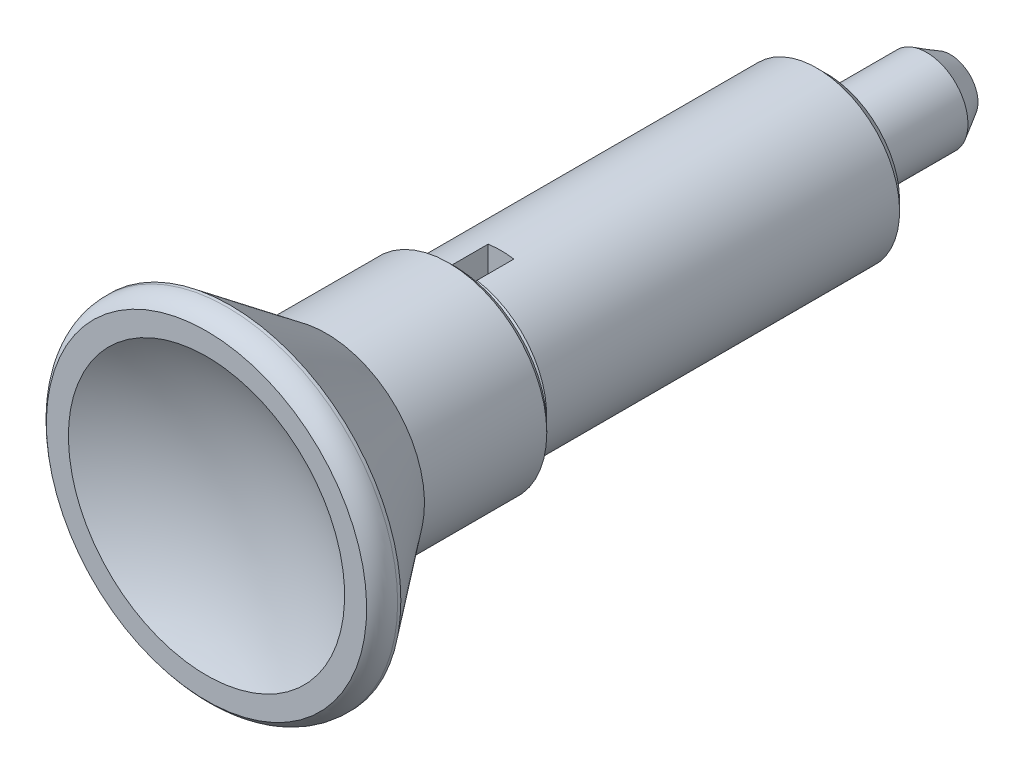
ISO-10303-21;
HEADER;
FILE_DESCRIPTION(('STEP AP214'),'2;1');
FILE_NAME('part.step','',(''),(''),'','','');
FILE_SCHEMA(('AUTOMOTIVE_DESIGN { 1 0 10303 214 1 1 1 1 }'));
ENDSEC;
DATA;
#1=APPLICATION_CONTEXT('core data for automotive mechanical design processes');
#2=APPLICATION_PROTOCOL_DEFINITION('international standard','automotive_design',2000,#1);
#3=PRODUCT_CONTEXT('',#1,'mechanical');
#4=PRODUCT('Part','Part','',(#3));
#5=PRODUCT_RELATED_PRODUCT_CATEGORY('part','',(#4));
#6=PRODUCT_DEFINITION_FORMATION('','',#4);
#7=PRODUCT_DEFINITION_CONTEXT('part definition',#1,'design');
#8=PRODUCT_DEFINITION('design','',#6,#7);
#9=PRODUCT_DEFINITION_SHAPE('','',#8);
#10=(LENGTH_UNIT() NAMED_UNIT(*) SI_UNIT(.MILLI.,.METRE.));
#11=(NAMED_UNIT(*) PLANE_ANGLE_UNIT() SI_UNIT($,.RADIAN.));
#12=(NAMED_UNIT(*) SI_UNIT($,.STERADIAN.) SOLID_ANGLE_UNIT());
#13=UNCERTAINTY_MEASURE_WITH_UNIT(LENGTH_MEASURE(1.E-05),#10,'distance_accuracy_value','');
#14=(GEOMETRIC_REPRESENTATION_CONTEXT(3) GLOBAL_UNCERTAINTY_ASSIGNED_CONTEXT((#13)) GLOBAL_UNIT_ASSIGNED_CONTEXT((#10,
#11,#12)) REPRESENTATION_CONTEXT('',''));
#15=CARTESIAN_POINT('',(0.,0.,0.));
#16=DIRECTION('',(0.,0.,1.));
#17=DIRECTION('',(1.,0.,0.));
#18=AXIS2_PLACEMENT_3D('',#15,#16,#17);
#19=CARTESIAN_POINT('',(-1.25,-19.,31.5));
#20=DIRECTION('',(0.,0.,1.));
#21=DIRECTION('',(0.,-1.,0.));
#22=AXIS2_PLACEMENT_3D('',#19,#20,#21);
#23=PLANE('',#22);
#24=DIRECTION('',(0.,1.,0.));
#25=VECTOR('',#24,1.);
#26=CARTESIAN_POINT('',(-1.25,-19.,31.5));
#27=LINE('',#26,#25);
#28=CARTESIAN_POINT('',(-1.25,-7.90174031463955,31.5));
#29=VERTEX_POINT('',#28);
#30=CARTESIAN_POINT('',(-1.25,-3.79967103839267,31.5));
#31=VERTEX_POINT('',#30);
#32=EDGE_CURVE('E83',#29,#31,#27,.T.);
#33=ORIENTED_EDGE('',*,*,#32,.F.);
#34=CARTESIAN_POINT('',(0.,0.,31.5));
#35=DIRECTION('',(0.,0.,1.));
#36=DIRECTION('',(0.,-1.,0.));
#37=AXIS2_PLACEMENT_3D('',#34,#35,#36);
#38=CIRCLE('',#37,8.);
#39=CARTESIAN_POINT('',(1.25,-7.90174031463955,31.5));
#40=VERTEX_POINT('',#39);
#41=EDGE_CURVE('E77',#40,#29,#38,.F.);
#42=ORIENTED_EDGE('',*,*,#41,.F.);
#43=DIRECTION('',(0.,-1.,0.));
#44=VECTOR('',#43,1.);
#45=CARTESIAN_POINT('',(1.25,-19.,31.5));
#46=LINE('',#45,#44);
#47=CARTESIAN_POINT('',(1.25,-3.79967103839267,31.5));
#48=VERTEX_POINT('',#47);
#49=EDGE_CURVE('E80',#48,#40,#46,.T.);
#50=ORIENTED_EDGE('',*,*,#49,.F.);
#51=CARTESIAN_POINT('',(0.,0.,31.5));
#52=DIRECTION('',(0.,0.,1.));
#53=DIRECTION('',(0.,-1.,0.));
#54=AXIS2_PLACEMENT_3D('',#51,#52,#53);
#55=CIRCLE('',#54,4.);
#56=EDGE_CURVE('E102',#31,#48,#55,.T.);
#57=ORIENTED_EDGE('',*,*,#56,.F.);
#58=EDGE_LOOP('',(#33,#42,#50,#57));
#59=FACE_BOUND('',#58,.T.);
#60=ADVANCED_FACE('F14',(#59),#23,.T.);
#61=CARTESIAN_POINT('',(-1.25,-19.,31.5));
#62=DIRECTION('',(0.,0.,1.));
#63=DIRECTION('',(0.,-1.,0.));
#64=AXIS2_PLACEMENT_3D('',#61,#62,#63);
#65=PLANE('',#64);
#66=DIRECTION('',(0.,-1.,0.));
#67=VECTOR('',#66,1.);
#68=CARTESIAN_POINT('',(1.25,-19.,31.5));
#69=LINE('',#68,#67);
#70=CARTESIAN_POINT('',(1.25,7.90174031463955,31.5));
#71=VERTEX_POINT('',#70);
#72=CARTESIAN_POINT('',(1.25,3.79967103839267,31.5));
#73=VERTEX_POINT('',#72);
#74=EDGE_CURVE('E210',#71,#73,#69,.T.);
#75=ORIENTED_EDGE('',*,*,#74,.F.);
#76=CARTESIAN_POINT('',(0.,0.,31.5));
#77=DIRECTION('',(0.,0.,1.));
#78=DIRECTION('',(0.,-1.,0.));
#79=AXIS2_PLACEMENT_3D('',#76,#77,#78);
#80=CIRCLE('',#79,8.);
#81=CARTESIAN_POINT('',(-1.25,7.90174031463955,31.5));
#82=VERTEX_POINT('',#81);
#83=EDGE_CURVE('E86',#82,#71,#80,.F.);
#84=ORIENTED_EDGE('',*,*,#83,.F.);
#85=DIRECTION('',(0.,1.,0.));
#86=VECTOR('',#85,1.);
#87=CARTESIAN_POINT('',(-1.25,-19.,31.5));
#88=LINE('',#87,#86);
#89=CARTESIAN_POINT('',(-1.25,3.79967103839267,31.5));
#90=VERTEX_POINT('',#89);
#91=EDGE_CURVE('E228',#90,#82,#88,.T.);
#92=ORIENTED_EDGE('',*,*,#91,.F.);
#93=CARTESIAN_POINT('',(0.,0.,31.5));
#94=DIRECTION('',(0.,0.,1.));
#95=DIRECTION('',(0.,-1.,0.));
#96=AXIS2_PLACEMENT_3D('',#93,#94,#95);
#97=CIRCLE('',#96,4.);
#98=EDGE_CURVE('E214',#73,#90,#97,.T.);
#99=ORIENTED_EDGE('',*,*,#98,.F.);
#100=EDGE_LOOP('',(#75,#84,#92,#99));
#101=FACE_BOUND('',#100,.T.);
#102=ADVANCED_FACE('F253',(#101),#65,.T.);
#103=CARTESIAN_POINT('',(0.,0.,0.));
#104=DIRECTION('',(0.,0.,1.));
#105=DIRECTION('',(0.,-1.,0.));
#106=AXIS2_PLACEMENT_3D('',#103,#104,#105);
#107=CYLINDRICAL_SURFACE('',#106,8.);
#108=DIRECTION('',(0.,0.,1.));
#109=VECTOR('',#108,1.);
#110=CARTESIAN_POINT('',(-1.25,7.90174031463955,36.));
#111=LINE('',#110,#109);
#112=CARTESIAN_POINT('',(-1.25,7.90174031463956,35.08));
#113=VERTEX_POINT('',#112);
#114=EDGE_CURVE('E231',#82,#113,#111,.T.);
#115=ORIENTED_EDGE('',*,*,#114,.F.);
#116=ORIENTED_EDGE('',*,*,#83,.T.);
#117=DIRECTION('',(0.,0.,1.));
#118=VECTOR('',#117,1.);
#119=CARTESIAN_POINT('',(1.25,7.90174031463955,31.5));
#120=LINE('',#119,#118);
#121=CARTESIAN_POINT('',(1.25,7.90174031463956,35.08));
#122=VERTEX_POINT('',#121);
#123=EDGE_CURVE('E209',#122,#71,#120,.F.);
#124=ORIENTED_EDGE('',*,*,#123,.F.);
#125=CARTESIAN_POINT('',(0.,0.,35.08));
#126=DIRECTION('',(0.,0.,-1.));
#127=DIRECTION('',(0.,1.,0.));
#128=AXIS2_PLACEMENT_3D('',#125,#126,#127);
#129=CIRCLE('',#128,8.);
#130=CARTESIAN_POINT('',(1.25,-7.90174031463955,35.08));
#131=VERTEX_POINT('',#130);
#132=EDGE_CURVE('E98',#131,#122,#129,.F.);
#133=ORIENTED_EDGE('',*,*,#132,.F.);
#134=DIRECTION('',(0.,0.,1.));
#135=VECTOR('',#134,1.);
#136=CARTESIAN_POINT('',(1.25,-7.90174031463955,31.5));
#137=LINE('',#136,#135);
#138=EDGE_CURVE('E91',#40,#131,#137,.T.);
#139=ORIENTED_EDGE('',*,*,#138,.F.);
#140=ORIENTED_EDGE('',*,*,#41,.T.);
#141=DIRECTION('',(0.,0.,1.));
#142=VECTOR('',#141,1.);
#143=CARTESIAN_POINT('',(-1.25,-7.90174031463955,36.));
#144=LINE('',#143,#142);
#145=CARTESIAN_POINT('',(-1.25,-7.90174031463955,35.08));
#146=VERTEX_POINT('',#145);
#147=EDGE_CURVE('E219',#146,#29,#144,.F.);
#148=ORIENTED_EDGE('',*,*,#147,.F.);
#149=CARTESIAN_POINT('',(0.,0.,35.08));
#150=DIRECTION('',(0.,0.,-1.));
#151=DIRECTION('',(0.,1.,0.));
#152=AXIS2_PLACEMENT_3D('',#149,#150,#151);
#153=CIRCLE('',#152,8.);
#154=EDGE_CURVE('E233',#113,#146,#153,.F.);
#155=ORIENTED_EDGE('',*,*,#154,.F.);
#156=EDGE_LOOP('',(#115,#116,#124,#133,#139,#140,#148,#155));
#157=FACE_BOUND('',#156,.T.);
#158=CARTESIAN_POINT('',(0.,0.,0.92));
#159=DIRECTION('',(0.,0.,1.));
#160=DIRECTION('',(0.,-1.,0.));
#161=AXIS2_PLACEMENT_3D('',#158,#159,#160);
#162=CIRCLE('',#161,8.);
#163=CARTESIAN_POINT('',(0.,-8.,0.92));
#164=VERTEX_POINT('',#163);
#165=EDGE_CURVE('E87',#164,#164,#162,.T.);
#166=ORIENTED_EDGE('',*,*,#165,.T.);
#167=EDGE_LOOP('',(#166));
#168=FACE_BOUND('',#167,.T.);
#169=ADVANCED_FACE('F93',(#157,#168),#107,.T.);
#170=CARTESIAN_POINT('',(1.25,-19.,31.5));
#171=DIRECTION('',(-1.,0.,0.));
#172=DIRECTION('',(0.,-1.,0.));
#173=AXIS2_PLACEMENT_3D('',#170,#171,#172);
#174=PLANE('',#173);
#175=ORIENTED_EDGE('',*,*,#138,.T.);
#176=CARTESIAN_POINT('',(1.25,-6.9687803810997,36.));
#177=CARTESIAN_POINT('',(1.25,-7.12440639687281,35.8468012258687));
#178=CARTESIAN_POINT('',(1.25,-7.279966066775,35.6935351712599));
#179=CARTESIAN_POINT('',(1.25,-7.59095271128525,35.3868685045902));
#180=CARTESIAN_POINT('',(1.25,-7.74637968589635,35.2334678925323));
#181=CARTESIAN_POINT('',(1.25,-7.90174031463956,35.08));
#182=B_SPLINE_CURVE_WITH_KNOTS('',3,(#176,#177,#178,#179,#180,#181),.UNSPECIFIED.,.F.,.F.,(4,2,
4),(0.,0.655136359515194,1.31027270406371),.UNSPECIFIED.);
#183=CARTESIAN_POINT('',(1.25,-6.9687803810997,36.));
#184=VERTEX_POINT('',#183);
#185=EDGE_CURVE('E222',#184,#131,#182,.T.);
#186=ORIENTED_EDGE('',*,*,#185,.F.);
#187=DIRECTION('',(0.,-1.,0.));
#188=VECTOR('',#187,1.);
#189=CARTESIAN_POINT('',(1.25,0.,36.));
#190=LINE('',#189,#188);
#191=CARTESIAN_POINT('',(1.25,-3.79967103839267,36.));
#192=VERTEX_POINT('',#191);
#193=EDGE_CURVE('E204',#184,#192,#190,.F.);
#194=ORIENTED_EDGE('',*,*,#193,.T.);
#195=DIRECTION('',(0.,0.,1.));
#196=VECTOR('',#195,1.);
#197=CARTESIAN_POINT('',(1.25,-3.79967103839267,-12.));
#198=LINE('',#197,#196);
#199=EDGE_CURVE('E107',#48,#192,#198,.T.);
#200=ORIENTED_EDGE('',*,*,#199,.F.);
#201=ORIENTED_EDGE('',*,*,#49,.T.);
#202=EDGE_LOOP('',(#175,#186,#194,#200,#201));
#203=FACE_BOUND('',#202,.T.);
#204=ADVANCED_FACE('F104',(#203),#174,.T.);
#205=CARTESIAN_POINT('',(0.,0.,-12.));
#206=DIRECTION('',(0.,0.,1.));
#207=DIRECTION('',(0.,-1.,0.));
#208=AXIS2_PLACEMENT_3D('',#205,#206,#207);
#209=CYLINDRICAL_SURFACE('',#208,4.);
#210=ORIENTED_EDGE('',*,*,#199,.T.);
#211=CARTESIAN_POINT('',(0.,0.,36.));
#212=DIRECTION('',(0.,0.,1.));
#213=DIRECTION('',(0.,-1.,0.));
#214=AXIS2_PLACEMENT_3D('',#211,#212,#213);
#215=CIRCLE('',#214,4.);
#216=CARTESIAN_POINT('',(-1.25,-3.79967103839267,36.));
#217=VERTEX_POINT('',#216);
#218=EDGE_CURVE('E203',#192,#217,#215,.F.);
#219=ORIENTED_EDGE('',*,*,#218,.T.);
#220=DIRECTION('',(0.,0.,1.));
#221=VECTOR('',#220,1.);
#222=CARTESIAN_POINT('',(-1.25,-3.79967103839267,36.));
#223=LINE('',#222,#221);
#224=EDGE_CURVE('E216',#31,#217,#223,.T.);
#225=ORIENTED_EDGE('',*,*,#224,.F.);
#226=ORIENTED_EDGE('',*,*,#56,.T.);
#227=EDGE_LOOP('',(#210,#219,#225,#226));
#228=FACE_BOUND('',#227,.T.);
#229=ADVANCED_FACE('F281',(#228),#209,.T.);
#230=CARTESIAN_POINT('',(-1.25,-19.,36.));
#231=DIRECTION('',(1.,0.,0.));
#232=DIRECTION('',(0.,1.,0.));
#233=AXIS2_PLACEMENT_3D('',#230,#231,#232);
#234=PLANE('',#233);
#235=CARTESIAN_POINT('',(-1.25,-7.90174031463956,35.08));
#236=CARTESIAN_POINT('',(-1.25,-7.74637968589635,35.2334678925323));
#237=CARTESIAN_POINT('',(-1.25,-7.59095271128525,35.3868685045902));
#238=CARTESIAN_POINT('',(-1.25,-7.279966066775,35.6935351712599));
#239=CARTESIAN_POINT('',(-1.25,-7.12440639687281,35.8468012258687));
#240=CARTESIAN_POINT('',(-1.25,-6.9687803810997,36.));
#241=B_SPLINE_CURVE_WITH_KNOTS('',3,(#235,#236,#237,#238,#239,#240),.UNSPECIFIED.,.F.,.F.,(4,2,
4),(0.,0.655136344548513,1.31027270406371),.UNSPECIFIED.);
#242=CARTESIAN_POINT('',(-1.25,-6.9687803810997,36.));
#243=VERTEX_POINT('',#242);
#244=EDGE_CURVE('E232',#146,#243,#241,.T.);
#245=ORIENTED_EDGE('',*,*,#244,.F.);
#246=ORIENTED_EDGE('',*,*,#147,.T.);
#247=ORIENTED_EDGE('',*,*,#32,.T.);
#248=ORIENTED_EDGE('',*,*,#224,.T.);
#249=DIRECTION('',(0.,-1.,0.));
#250=VECTOR('',#249,1.);
#251=CARTESIAN_POINT('',(-1.25,0.,36.));
#252=LINE('',#251,#250);
#253=EDGE_CURVE('E201',#217,#243,#252,.T.);
#254=ORIENTED_EDGE('',*,*,#253,.T.);
#255=EDGE_LOOP('',(#245,#246,#247,#248,#254));
#256=FACE_BOUND('',#255,.T.);
#257=ADVANCED_FACE('F239',(#256),#234,.T.);
#258=CARTESIAN_POINT('',(0.,0.,35.08));
#259=DIRECTION('',(0.,0.,-1.));
#260=DIRECTION('',(0.,1.,0.));
#261=AXIS2_PLACEMENT_3D('',#258,#259,#260);
#262=CONICAL_SURFACE('',#261,8.,0.78539816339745);
#263=ORIENTED_EDGE('',*,*,#244,.T.);
#264=CARTESIAN_POINT('',(0.,0.,36.));
#265=DIRECTION('',(0.,0.,-1.));
#266=DIRECTION('',(0.,1.,0.));
#267=AXIS2_PLACEMENT_3D('',#264,#265,#266);
#268=CIRCLE('',#267,7.08);
#269=CARTESIAN_POINT('',(-1.25,6.9687803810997,36.));
#270=VERTEX_POINT('',#269);
#271=EDGE_CURVE('E200',#243,#270,#268,.T.);
#272=ORIENTED_EDGE('',*,*,#271,.T.);
#273=CARTESIAN_POINT('',(-1.25,7.90174031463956,35.08));
#274=CARTESIAN_POINT('',(-1.25,7.74637968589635,35.2334678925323));
#275=CARTESIAN_POINT('',(-1.25,7.59095271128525,35.3868685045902));
#276=CARTESIAN_POINT('',(-1.25,7.279966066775,35.6935351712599));
#277=CARTESIAN_POINT('',(-1.25,7.12440639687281,35.8468012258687));
#278=CARTESIAN_POINT('',(-1.25,6.9687803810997,36.));
#279=B_SPLINE_CURVE_WITH_KNOTS('',3,(#273,#274,#275,#276,#277,#278),.UNSPECIFIED.,.F.,.F.,(4,2,
4),(0.,0.655136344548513,1.31027270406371),.UNSPECIFIED.);
#280=EDGE_CURVE('E215',#113,#270,#279,.T.);
#281=ORIENTED_EDGE('',*,*,#280,.F.);
#282=ORIENTED_EDGE('',*,*,#154,.T.);
#283=EDGE_LOOP('',(#263,#272,#281,#282));
#284=FACE_BOUND('',#283,.T.);
#285=ADVANCED_FACE('F244',(#284),#262,.T.);
#286=CARTESIAN_POINT('',(-1.25,-19.,36.));
#287=DIRECTION('',(1.,0.,0.));
#288=DIRECTION('',(0.,1.,0.));
#289=AXIS2_PLACEMENT_3D('',#286,#287,#288);
#290=PLANE('',#289);
#291=ORIENTED_EDGE('',*,*,#114,.T.);
#292=ORIENTED_EDGE('',*,*,#280,.T.);
#293=DIRECTION('',(0.,-1.,0.));
#294=VECTOR('',#293,1.);
#295=CARTESIAN_POINT('',(-1.25,0.,36.));
#296=LINE('',#295,#294);
#297=CARTESIAN_POINT('',(-1.25,3.79967103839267,36.));
#298=VERTEX_POINT('',#297);
#299=EDGE_CURVE('E197',#270,#298,#296,.T.);
#300=ORIENTED_EDGE('',*,*,#299,.T.);
#301=DIRECTION('',(0.,0.,1.));
#302=VECTOR('',#301,1.);
#303=CARTESIAN_POINT('',(-1.25,3.79967103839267,-12.));
#304=LINE('',#303,#302);
#305=EDGE_CURVE('E211',#90,#298,#304,.T.);
#306=ORIENTED_EDGE('',*,*,#305,.F.);
#307=ORIENTED_EDGE('',*,*,#91,.T.);
#308=EDGE_LOOP('',(#291,#292,#300,#306,#307));
#309=FACE_BOUND('',#308,.T.);
#310=ADVANCED_FACE('F249',(#309),#290,.T.);
#311=CARTESIAN_POINT('',(0.,0.,-12.));
#312=DIRECTION('',(0.,0.,1.));
#313=DIRECTION('',(0.,-1.,0.));
#314=AXIS2_PLACEMENT_3D('',#311,#312,#313);
#315=CYLINDRICAL_SURFACE('',#314,4.);
#316=DIRECTION('',(0.,0.,1.));
#317=VECTOR('',#316,1.);
#318=CARTESIAN_POINT('',(1.25,3.79967103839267,31.5));
#319=LINE('',#318,#317);
#320=CARTESIAN_POINT('',(1.25,3.79967103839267,36.));
#321=VERTEX_POINT('',#320);
#322=EDGE_CURVE('E207',#73,#321,#319,.T.);
#323=ORIENTED_EDGE('',*,*,#322,.F.);
#324=ORIENTED_EDGE('',*,*,#98,.T.);
#325=ORIENTED_EDGE('',*,*,#305,.T.);
#326=CARTESIAN_POINT('',(0.,0.,36.));
#327=DIRECTION('',(0.,0.,1.));
#328=DIRECTION('',(0.,-1.,0.));
#329=AXIS2_PLACEMENT_3D('',#326,#327,#328);
#330=CIRCLE('',#329,4.);
#331=EDGE_CURVE('E196',#298,#321,#330,.F.);
#332=ORIENTED_EDGE('',*,*,#331,.T.);
#333=EDGE_LOOP('',(#323,#324,#325,#332));
#334=FACE_BOUND('',#333,.T.);
#335=ADVANCED_FACE('F422',(#334),#315,.T.);
#336=CARTESIAN_POINT('',(1.25,-19.,31.5));
#337=DIRECTION('',(-1.,0.,0.));
#338=DIRECTION('',(0.,-1.,0.));
#339=AXIS2_PLACEMENT_3D('',#336,#337,#338);
#340=PLANE('',#339);
#341=CARTESIAN_POINT('',(1.25,7.90174031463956,35.08));
#342=CARTESIAN_POINT('',(1.25,7.74637968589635,35.2334678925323));
#343=CARTESIAN_POINT('',(1.25,7.59095271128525,35.3868685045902));
#344=CARTESIAN_POINT('',(1.25,7.279966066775,35.6935351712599));
#345=CARTESIAN_POINT('',(1.25,7.12440639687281,35.8468012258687));
#346=CARTESIAN_POINT('',(1.25,6.9687803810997,36.));
#347=B_SPLINE_CURVE_WITH_KNOTS('',3,(#341,#342,#343,#344,#345,#346),.UNSPECIFIED.,.F.,.F.,(4,2,
4),(0.,0.655136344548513,1.31027270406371),.UNSPECIFIED.);
#348=CARTESIAN_POINT('',(1.25,6.9687803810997,36.));
#349=VERTEX_POINT('',#348);
#350=EDGE_CURVE('E225',#122,#349,#347,.T.);
#351=ORIENTED_EDGE('',*,*,#350,.F.);
#352=ORIENTED_EDGE('',*,*,#123,.T.);
#353=ORIENTED_EDGE('',*,*,#74,.T.);
#354=ORIENTED_EDGE('',*,*,#322,.T.);
#355=DIRECTION('',(0.,-1.,0.));
#356=VECTOR('',#355,1.);
#357=CARTESIAN_POINT('',(1.25,0.,36.));
#358=LINE('',#357,#356);
#359=EDGE_CURVE('E33',#321,#349,#358,.F.);
#360=ORIENTED_EDGE('',*,*,#359,.T.);
#361=EDGE_LOOP('',(#351,#352,#353,#354,#360));
#362=FACE_BOUND('',#361,.T.);
#363=ADVANCED_FACE('F255',(#362),#340,.T.);
#364=CARTESIAN_POINT('',(0.,0.,35.08));
#365=DIRECTION('',(0.,0.,-1.));
#366=DIRECTION('',(0.,1.,0.));
#367=AXIS2_PLACEMENT_3D('',#364,#365,#366);
#368=CONICAL_SURFACE('',#367,8.,0.78539816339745);
#369=ORIENTED_EDGE('',*,*,#185,.T.);
#370=ORIENTED_EDGE('',*,*,#132,.T.);
#371=ORIENTED_EDGE('',*,*,#350,.T.);
#372=CARTESIAN_POINT('',(0.,0.,36.));
#373=DIRECTION('',(0.,0.,-1.));
#374=DIRECTION('',(0.,1.,0.));
#375=AXIS2_PLACEMENT_3D('',#372,#373,#374);
#376=CIRCLE('',#375,7.08);
#377=EDGE_CURVE('E141',#349,#184,#376,.T.);
#378=ORIENTED_EDGE('',*,*,#377,.T.);
#379=EDGE_LOOP('',(#369,#370,#371,#378));
#380=FACE_BOUND('',#379,.T.);
#381=ADVANCED_FACE('F163',(#380),#368,.T.);
#382=CARTESIAN_POINT('',(0.,0.,82.3));
#383=DIRECTION('',(-1.,0.,0.));
#384=DIRECTION('',(0.,1.,0.));
#385=AXIS2_PLACEMENT_3D('',#382,#383,#384);
#386=SPHERICAL_SURFACE('',#385,26.);
#387=CARTESIAN_POINT('',(0.,13.36824595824,60.));
#388=CARTESIAN_POINT('',(-0.375585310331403,13.3682486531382,60.));
#389=CARTESIAN_POINT('',(-0.751126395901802,13.3524111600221,60.));
#390=CARTESIAN_POINT('',(-1.49966463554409,13.2891717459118,60.));
#391=CARTESIAN_POINT('',(-1.87266109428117,13.2417615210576,60.));
#392=CARTESIAN_POINT('',(-2.61372997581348,13.1156339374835,60.));
#393=CARTESIAN_POINT('',(-2.98179666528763,13.0368829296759,60.));
#394=CARTESIAN_POINT('',(-3.70998226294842,12.848636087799,60.));
#395=CARTESIAN_POINT('',(-4.07010119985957,12.7391403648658,60.));
#396=CARTESIAN_POINT('',(-4.7796552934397,12.490243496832,60.));
#397=CARTESIAN_POINT('',(-5.12909553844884,12.3508568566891,60.));
#398=CARTESIAN_POINT('',(-5.81499557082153,12.0431356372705,60.));
#399=CARTESIAN_POINT('',(-6.15145515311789,11.8748006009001,60.));
#400=CARTESIAN_POINT('',(-6.80891126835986,11.5104276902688,60.));
#401=CARTESIAN_POINT('',(-7.12991172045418,11.3143968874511,60.));
#402=CARTESIAN_POINT('',(-7.75425858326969,10.8959942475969,60.));
#403=CARTESIAN_POINT('',(-8.05760506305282,10.6736225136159,60.));
#404=CARTESIAN_POINT('',(-8.64452045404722,10.2040929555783,60.));
#405=CARTESIAN_POINT('',(-8.92808725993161,9.95693249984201,60.));
#406=CARTESIAN_POINT('',(-9.47339223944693,9.43960204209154,60.));
#407=CARTESIAN_POINT('',(-9.7351303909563,9.16943201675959,60.));
#408=CARTESIAN_POINT('',(-10.2349267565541,8.60799236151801,60.));
#409=CARTESIAN_POINT('',(-10.472984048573,8.31672191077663,60.));
#410=CARTESIAN_POINT('',(-10.9237145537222,7.71516160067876,60.));
#411=CARTESIAN_POINT('',(-11.1363877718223,7.40487174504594,60.));
#412=CARTESIAN_POINT('',(-11.5348344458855,6.76748455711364,60.));
#413=CARTESIAN_POINT('',(-11.7206084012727,6.4403875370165,60.));
#414=CARTESIAN_POINT('',(-12.0639405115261,5.77170618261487,60.));
#415=CARTESIAN_POINT('',(-12.2214986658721,5.43012184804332,60.));
#416=CARTESIAN_POINT('',(-12.507278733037,4.73489504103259,60.));
#417=CARTESIAN_POINT('',(-12.6355007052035,4.38125259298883,60.));
#418=CARTESIAN_POINT('',(-12.8616972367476,3.66442308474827,60.));
#419=CARTESIAN_POINT('',(-12.95967179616,3.30123602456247,60.));
#420=CARTESIAN_POINT('',(-13.1246771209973,2.56789862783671,60.));
#421=CARTESIAN_POINT('',(-13.1917078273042,2.1977482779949,60.));
#422=CARTESIAN_POINT('',(-13.2943486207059,1.45311652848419,60.));
#423=CARTESIAN_POINT('',(-13.3299587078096,1.07863512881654,60.));
#424=CARTESIAN_POINT('',(-13.3695050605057,0.328004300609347,60.));
#425=CARTESIAN_POINT('',(-13.373441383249,-0.0481451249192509,60.));
#426=CARTESIAN_POINT('',(-13.3496123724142,-0.799438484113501,60.));
#427=CARTESIAN_POINT('',(-13.3218470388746,-1.17458241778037,60.));
#428=CARTESIAN_POINT('',(-13.2348120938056,-1.92119788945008,60.));
#429=CARTESIAN_POINT('',(-13.1755424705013,-2.29266942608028,60.));
#430=CARTESIAN_POINT('',(-13.0259203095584,-3.02929902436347,60.));
#431=CARTESIAN_POINT('',(-12.9355677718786,-3.3944570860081,60.));
#432=CARTESIAN_POINT('',(-12.7244220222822,-4.11586406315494,60.));
#433=CARTESIAN_POINT('',(-12.6036287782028,-4.47211296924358,60.));
#434=CARTESIAN_POINT('',(-12.3324604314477,-5.17316851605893,60.));
#435=CARTESIAN_POINT('',(-12.1820853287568,-5.51797515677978,60.));
#436=CARTESIAN_POINT('',(-11.8528223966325,-6.1936946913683,60.));
#437=CARTESIAN_POINT('',(-11.6739345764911,-6.52460758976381,60.));
#438=CARTESIAN_POINT('',(-11.2889179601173,-7.17018716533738,60.));
#439=CARTESIAN_POINT('',(-11.0827891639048,-7.48485384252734,60.));
#440=CARTESIAN_POINT('',(-10.644756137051,-8.09570375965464,60.));
#441=CARTESIAN_POINT('',(-10.4128519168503,-8.39188700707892,60.));
#442=CARTESIAN_POINT('',(-9.92491667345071,-8.96366451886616,60.));
#443=CARTESIAN_POINT('',(-9.66888565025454,-9.23925878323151,60.));
#444=CARTESIAN_POINT('',(-9.13451699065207,-9.76789905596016,60.));
#445=CARTESIAN_POINT('',(-8.85617935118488,-10.0209450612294,60.));
#446=CARTESIAN_POINT('',(-8.27917630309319,-10.5026897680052,60.));
#447=CARTESIAN_POINT('',(-7.98051089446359,-10.7313884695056,60.));
#448=CARTESIAN_POINT('',(-7.36497559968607,-11.1628126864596,60.));
#449=CARTESIAN_POINT('',(-7.0481057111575,-11.3655381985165,60.));
#450=CARTESIAN_POINT('',(-6.39841424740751,-11.7435747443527,60.));
#451=CARTESIAN_POINT('',(-6.06559267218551,-11.9188857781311,60.));
#452=CARTESIAN_POINT('',(-5.38636401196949,-12.2408470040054,60.));
#453=CARTESIAN_POINT('',(-5.03995692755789,-12.3874971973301,60.));
#454=CARTESIAN_POINT('',(-4.33601998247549,-12.6510941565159,60.));
#455=CARTESIAN_POINT('',(-3.97849012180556,-12.7680409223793,60.));
#456=CARTESIAN_POINT('',(-3.25484946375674,-12.9713996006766,60.));
#457=CARTESIAN_POINT('',(-2.88873866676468,-13.057811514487,60.));
#458=CARTESIAN_POINT('',(-2.15053894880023,-13.1994861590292,60.));
#459=CARTESIAN_POINT('',(-1.778450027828,-13.2547488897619,60.));
#460=CARTESIAN_POINT('',(-1.0309393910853,-13.3337322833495,60.));
#461=CARTESIAN_POINT('',(-0.655517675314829,-13.3574529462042,60.));
#462=CARTESIAN_POINT('',(0.0959895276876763,-13.3731835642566,60.));
#463=CARTESIAN_POINT('',(0.472075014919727,-13.3651935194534,60.));
#464=CARTESIAN_POINT('',(1.22223603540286,-13.3175595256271,60.));
#465=CARTESIAN_POINT('',(1.59631156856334,-13.277915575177,60.));
#466=CARTESIAN_POINT('',(2.33979321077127,-13.1672556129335,60.));
#467=CARTESIAN_POINT('',(2.70919931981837,-13.0962396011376,60.));
#468=CARTESIAN_POINT('',(3.44071587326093,-12.9233403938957,60.));
#469=CARTESIAN_POINT('',(3.80282631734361,-12.8214571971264,60.));
#470=CARTESIAN_POINT('',(4.5171771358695,-12.5875479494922,60.));
#471=CARTESIAN_POINT('',(4.86941751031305,-12.4555218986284,60.));
#472=CARTESIAN_POINT('',(5.56152392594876,-12.1622655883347,60.));
#473=CARTESIAN_POINT('',(5.90138996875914,-12.001035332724,60.));
#474=CARTESIAN_POINT('',(6.56633152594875,-11.650516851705,60.));
#475=CARTESIAN_POINT('',(6.8914070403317,-11.4612286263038,60.));
#476=CARTESIAN_POINT('',(7.52445640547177,-11.0559399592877,60.));
#477=CARTESIAN_POINT('',(7.83243025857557,-10.8399395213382,60.));
#478=CARTESIAN_POINT('',(8.42908684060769,-10.3827620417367,60.));
#479=CARTESIAN_POINT('',(8.71776956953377,-10.1415850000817,60.));
#480=CARTESIAN_POINT('',(9.2737916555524,-9.6357688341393,60.));
#481=CARTESIAN_POINT('',(9.54113100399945,-9.37112970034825,60.));
#482=CARTESIAN_POINT('',(10.0525655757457,-8.820270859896,60.));
#483=CARTESIAN_POINT('',(10.2966607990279,-8.53405115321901,60.));
#484=CARTESIAN_POINT('',(10.7598718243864,-7.94206592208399,60.));
#485=CARTESIAN_POINT('',(10.9789876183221,-7.63630039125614,60.));
#486=CARTESIAN_POINT('',(11.3906819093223,-7.00739740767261,60.));
#487=CARTESIAN_POINT('',(11.5832604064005,-6.68425995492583,60.));
#488=CARTESIAN_POINT('',(11.9405107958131,-6.02291079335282,60.));
#489=CARTESIAN_POINT('',(12.1051827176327,-5.68469910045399,60.));
#490=CARTESIAN_POINT('',(12.4054494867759,-4.99560562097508,60.));
#491=CARTESIAN_POINT('',(12.5410443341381,-4.64472383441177,60.));
#492=CARTESIAN_POINT('',(12.7821929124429,-3.93278485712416,60.));
#493=CARTESIAN_POINT('',(12.8877466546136,-3.57172767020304,60.));
#494=CARTESIAN_POINT('',(13.0680626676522,-2.84200466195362,60.));
#495=CARTESIAN_POINT('',(13.1428249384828,-2.47333884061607,60.));
#496=CARTESIAN_POINT('',(13.2610266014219,-1.73101888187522,60.));
#497=CARTESIAN_POINT('',(13.3044659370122,-1.35736473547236,60.));
#498=CARTESIAN_POINT('',(13.3597126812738,-0.607725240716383,60.));
#499=CARTESIAN_POINT('',(13.371520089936,-0.231739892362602,60.));
#500=CARTESIAN_POINT('',(13.3634190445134,0.519888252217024,60.));
#501=CARTESIAN_POINT('',(13.3435106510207,0.895531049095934,60.));
#502=CARTESIAN_POINT('',(13.2721196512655,1.64380422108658,60.));
#503=CARTESIAN_POINT('',(13.2206370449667,2.01643459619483,60.));
#504=CARTESIAN_POINT('',(13.0864634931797,2.75603450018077,60.));
#505=CARTESIAN_POINT('',(13.0037724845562,3.12300401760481,60.));
#506=CARTESIAN_POINT('',(12.8077700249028,3.84867248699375,60.));
#507=CARTESIAN_POINT('',(12.6944585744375,4.20737143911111,60.));
#508=CARTESIAN_POINT('',(12.4380184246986,4.91395521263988,60.));
#509=CARTESIAN_POINT('',(12.2948891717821,5.26183983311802,60.));
#510=CARTESIAN_POINT('',(11.9798322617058,5.94431469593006,60.));
#511=CARTESIAN_POINT('',(11.8079045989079,6.27890493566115,60.));
#512=CARTESIAN_POINT('',(11.4364804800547,6.93239940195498,60.));
#513=CARTESIAN_POINT('',(11.2369850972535,7.25130423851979,60.));
#514=CARTESIAN_POINT('',(10.8118388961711,7.87117441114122,60.));
#515=CARTESIAN_POINT('',(10.5861881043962,8.1721397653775,60.));
#516=CARTESIAN_POINT('',(10.1103604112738,8.75396077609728,60.));
#517=CARTESIAN_POINT('',(9.86018611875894,9.03481856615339,60.));
#518=CARTESIAN_POINT('',(9.33706848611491,9.5744644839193,60.));
#519=CARTESIAN_POINT('',(9.06412505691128,9.83325252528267,60.));
#520=CARTESIAN_POINT('',(8.49733759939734,10.3269813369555,60.));
#521=CARTESIAN_POINT('',(8.20348826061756,10.5619160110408,60.));
#522=CARTESIAN_POINT('',(7.59704532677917,11.0061886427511,60.));
#523=CARTESIAN_POINT('',(7.28445202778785,11.21552700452,60.));
#524=CARTESIAN_POINT('',(6.64258363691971,11.6072177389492,60.));
#525=CARTESIAN_POINT('',(6.31330053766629,11.7895569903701,60.));
#526=CARTESIAN_POINT('',(5.6405367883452,12.1258308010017,60.));
#527=CARTESIAN_POINT('',(5.29705608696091,12.2797652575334,60.));
#528=CARTESIAN_POINT('',(4.59871120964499,12.5579840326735,60.));
#529=CARTESIAN_POINT('',(4.24385967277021,12.6823000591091,60.));
#530=CARTESIAN_POINT('',(3.52506734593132,12.9005804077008,60.));
#531=CARTESIAN_POINT('',(3.16112897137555,12.9945527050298,60.));
#532=CARTESIAN_POINT('',(2.33514245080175,13.1710678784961,60.));
#533=CARTESIAN_POINT('',(1.87121744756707,13.2449469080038,60.));
#534=CARTESIAN_POINT('',(0.938171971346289,13.3435342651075,60.));
#535=CARTESIAN_POINT('',(0.469051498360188,13.3682425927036,60.));
#536=CARTESIAN_POINT('',(0.,13.36824595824,60.));
#537=B_SPLINE_CURVE_WITH_KNOTS('',3,(#387,#388,#389,#390,#391,#392,#393,#394,#395,#396,#397,
#398,#399,#400,#401,#402,#403,#404,#405,#406,#407,#408,#409,#410,#411,#412,#413,#414,#415,#416,
#417,#418,#419,#420,#421,#422,#423,#424,#425,#426,#427,#428,#429,#430,#431,#432,#433,#434,#435,
#436,#437,#438,#439,#440,#441,#442,#443,#444,#445,#446,#447,#448,#449,#450,#451,#452,#453,#454,
#455,#456,#457,#458,#459,#460,#461,#462,#463,#464,#465,#466,#467,#468,#469,#470,#471,#472,#473,
#474,#475,#476,#477,#478,#479,#480,#481,#482,#483,#484,#485,#486,#487,#488,#489,#490,#491,#492,
#493,#494,#495,#496,#497,#498,#499,#500,#501,#502,#503,#504,#505,#506,#507,#508,#509,#510,#511,
#512,#513,#514,#515,#516,#517,#518,#519,#520,#521,#522,#523,#524,#525,#526,#527,#528,#529,#530,
#531,#532,#533,#534,#535,#536),.UNSPECIFIED.,.T.,.F.,(4,2,2,2,2,2,2,2,2,2,2,2,2,2,2,2,2,2,2,2,2,
2,2,2,2,2,2,2,2,2,2,2,2,2,2,2,2,2,2,2,2,2,2,2,2,2,2,2,2,2,2,2,2,2,2,2,2,2,2,2,2,2,2,2,2,2,2,2,2,
2,2,2,2,2,4),(0.,1.12634621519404,2.25298878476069,3.38084425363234,4.50869564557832,
5.63600096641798,6.76332408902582,7.89035989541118,9.01739129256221,10.1445424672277,
11.2716947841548,12.3988909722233,13.5260869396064,14.6532619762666,15.7804370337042,
16.9076098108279,18.034782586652,19.1619575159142,20.2891324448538,21.4163053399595,
22.5434782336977,23.6706515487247,24.7978248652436,25.9249993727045,27.0521738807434,
28.1793480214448,29.306522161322,30.4336958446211,31.560869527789,32.6880433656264,
33.8152172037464,34.9423911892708,36.0695651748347,37.1967391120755,38.3239130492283,
39.4510869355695,40.5782608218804,41.7054347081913,42.8326085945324,43.9597825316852,
45.086956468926,46.21413045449,47.3413044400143,48.4684782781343,49.5956521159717,
50.7228257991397,51.8499994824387,52.9771736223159,54.1043477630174,55.2315222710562,
56.3586967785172,57.485870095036,58.613043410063,59.7402163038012,60.867389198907,
61.9945641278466,63.1217390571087,64.2489118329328,65.3760846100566,66.5032596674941,
67.6304347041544,68.7576306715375,69.8848268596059,71.0119791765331,72.1391303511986,
73.2661617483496,74.3931975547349,75.5205206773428,76.6478259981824,77.7756773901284,
78.9035328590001,80.0301754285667,81.1565216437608,82.5631644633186,83.9698072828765),.UNSPECIFIED.);
#538=CARTESIAN_POINT('',(0.,13.36824595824,60.));
#539=VERTEX_POINT('',#538);
#540=EDGE_CURVE('E133',#539,#539,#537,.T.);
#541=ORIENTED_EDGE('',*,*,#540,.T.);
#542=EDGE_LOOP('',(#541));
#543=FACE_BOUND('',#542,.T.);
#544=ADVANCED_FACE('F143',(#543),#386,.F.);
#545=CARTESIAN_POINT('',(8.93431457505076,0.,36.));
#546=DIRECTION('',(0.,0.,1.));
#547=DIRECTION('',(0.,-1.,0.));
#548=AXIS2_PLACEMENT_3D('',#545,#546,#547);
#549=PLANE('',#548);
#550=CARTESIAN_POINT('',(0.,0.,36.));
#551=DIRECTION('',(0.,0.,1.));
#552=DIRECTION('',(-1.,0.,0.));
#553=AXIS2_PLACEMENT_3D('',#550,#551,#552);
#554=CIRCLE('',#553,8.93431457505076);
#555=CARTESIAN_POINT('',(-8.93431457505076,0.,36.));
#556=VERTEX_POINT('',#555);
#557=EDGE_CURVE('E130',#556,#556,#554,.T.);
#558=ORIENTED_EDGE('',*,*,#557,.F.);
#559=EDGE_LOOP('',(#558));
#560=FACE_BOUND('',#559,.T.);
#561=ORIENTED_EDGE('',*,*,#359,.F.);
#562=ORIENTED_EDGE('',*,*,#331,.F.);
#563=ORIENTED_EDGE('',*,*,#299,.F.);
#564=ORIENTED_EDGE('',*,*,#271,.F.);
#565=ORIENTED_EDGE('',*,*,#253,.F.);
#566=ORIENTED_EDGE('',*,*,#218,.F.);
#567=ORIENTED_EDGE('',*,*,#193,.F.);
#568=ORIENTED_EDGE('',*,*,#377,.F.);
#569=EDGE_LOOP('',(#561,#562,#563,#564,#565,#566,#567,#568));
#570=FACE_BOUND('',#569,.T.);
#571=ADVANCED_FACE('F153',(#560,#570),#549,.F.);
#572=CARTESIAN_POINT('',(13.36824595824,0.,60.));
#573=DIRECTION('',(0.,0.,-1.));
#574=DIRECTION('',(0.,1.,0.));
#575=AXIS2_PLACEMENT_3D('',#572,#573,#574);
#576=PLANE('',#575);
#577=ORIENTED_EDGE('',*,*,#540,.F.);
#578=EDGE_LOOP('',(#577));
#579=FACE_BOUND('',#578,.T.);
#580=CARTESIAN_POINT('',(0.,0.,60.));
#581=DIRECTION('',(0.,0.,-1.));
#582=DIRECTION('',(0.,1.,0.));
#583=AXIS2_PLACEMENT_3D('',#580,#581,#582);
#584=CIRCLE('',#583,15.5);
#585=CARTESIAN_POINT('',(0.,15.5,60.));
#586=VERTEX_POINT('',#585);
#587=EDGE_CURVE('E126',#586,#586,#584,.T.);
#588=ORIENTED_EDGE('',*,*,#587,.F.);
#589=EDGE_LOOP('',(#588));
#590=FACE_BOUND('',#589,.T.);
#591=ADVANCED_FACE('F148',(#579,#590),#576,.F.);
#592=CARTESIAN_POINT('',(0.,0.,36.5656854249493));
#593=DIRECTION('',(0.,0.,1.));
#594=DIRECTION('',(-1.,0.,0.));
#595=AXIS2_PLACEMENT_3D('',#592,#593,#594);
#596=CONICAL_SURFACE('',#595,9.5,0.785398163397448);
#597=CARTESIAN_POINT('',(0.,0.,36.5656854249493));
#598=DIRECTION('',(0.,0.,1.));
#599=DIRECTION('',(0.,-1.,0.));
#600=AXIS2_PLACEMENT_3D('',#597,#598,#599);
#601=CIRCLE('',#600,9.5);
#602=CARTESIAN_POINT('',(0.,-9.5,36.5656854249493));
#603=VERTEX_POINT('',#602);
#604=EDGE_CURVE('E129',#603,#603,#601,.T.);
#605=ORIENTED_EDGE('',*,*,#604,.F.);
#606=EDGE_LOOP('',(#605));
#607=FACE_BOUND('',#606,.T.);
#608=ORIENTED_EDGE('',*,*,#557,.T.);
#609=EDGE_LOOP('',(#608));
#610=FACE_BOUND('',#609,.T.);
#611=ADVANCED_FACE('F152',(#607,#610),#596,.T.);
#612=CARTESIAN_POINT('',(0.,0.,58.));
#613=DIRECTION('',(0.,0.,-1.));
#614=DIRECTION('',(0.,1.,0.));
#615=AXIS2_PLACEMENT_3D('',#612,#613,#614);
#616=TOROIDAL_SURFACE('',#615,14.,2.5);
#617=CARTESIAN_POINT('',(0.,0.,58.));
#618=DIRECTION('',(0.,0.,1.));
#619=DIRECTION('',(0.,-1.,0.));
#620=AXIS2_PLACEMENT_3D('',#617,#618,#619);
#621=CIRCLE('',#620,16.5);
#622=CARTESIAN_POINT('',(0.,-16.5,58.));
#623=VERTEX_POINT('',#622);
#624=EDGE_CURVE('E500',#623,#623,#621,.F.);
#625=ORIENTED_EDGE('',*,*,#624,.F.);
#626=EDGE_LOOP('',(#625));
#627=FACE_BOUND('',#626,.T.);
#628=ORIENTED_EDGE('',*,*,#587,.T.);
#629=EDGE_LOOP('',(#628));
#630=FACE_BOUND('',#629,.T.);
#631=ADVANCED_FACE('F185',(#627,#630),#616,.T.);
#632=CARTESIAN_POINT('',(0.,0.,-12.));
#633=DIRECTION('',(0.,0.,1.));
#634=DIRECTION('',(0.,-1.,0.));
#635=AXIS2_PLACEMENT_3D('',#632,#633,#634);
#636=CYLINDRICAL_SURFACE('',#635,9.5);
#637=CARTESIAN_POINT('',(0.,0.,48.4));
#638=DIRECTION('',(0.,0.,1.));
#639=DIRECTION('',(0.,-1.,0.));
#640=AXIS2_PLACEMENT_3D('',#637,#638,#639);
#641=CIRCLE('',#640,9.5);
#642=CARTESIAN_POINT('',(0.,-9.5,48.4));
#643=VERTEX_POINT('',#642);
#644=EDGE_CURVE('E24',#643,#643,#641,.T.);
#645=ORIENTED_EDGE('',*,*,#644,.F.);
#646=EDGE_LOOP('',(#645));
#647=FACE_BOUND('',#646,.T.);
#648=ORIENTED_EDGE('',*,*,#604,.T.);
#649=EDGE_LOOP('',(#648));
#650=FACE_BOUND('',#649,.T.);
#651=ADVANCED_FACE('F179',(#647,#650),#636,.T.);
#652=CARTESIAN_POINT('',(0.,0.,-12.));
#653=DIRECTION('',(0.,0.,1.));
#654=DIRECTION('',(0.,-1.,0.));
#655=AXIS2_PLACEMENT_3D('',#652,#653,#654);
#656=CYLINDRICAL_SURFACE('',#655,16.5);
#657=ORIENTED_EDGE('',*,*,#624,.T.);
#658=EDGE_LOOP('',(#657));
#659=FACE_BOUND('',#658,.T.);
#660=CARTESIAN_POINT('',(0.,0.,57.6893137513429));
#661=DIRECTION('',(0.,0.,1.));
#662=DIRECTION('',(0.,-1.,0.));
#663=AXIS2_PLACEMENT_3D('',#660,#661,#662);
#664=CIRCLE('',#663,16.5);
#665=CARTESIAN_POINT('',(0.,-16.5,57.6893137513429));
#666=VERTEX_POINT('',#665);
#667=EDGE_CURVE('E9',#666,#666,#664,.F.);
#668=ORIENTED_EDGE('',*,*,#667,.F.);
#669=EDGE_LOOP('',(#668));
#670=FACE_BOUND('',#669,.T.);
#671=ADVANCED_FACE('F169',(#659,#670),#656,.T.);
#672=CARTESIAN_POINT('',(0.,0.,57.6893137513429));
#673=DIRECTION('',(0.,0.,1.));
#674=DIRECTION('',(0.,-1.,0.));
#675=AXIS2_PLACEMENT_3D('',#672,#673,#674);
#676=CONICAL_SURFACE('',#675,16.5,0.645771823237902);
#677=ORIENTED_EDGE('',*,*,#667,.T.);
#678=EDGE_LOOP('',(#677));
#679=FACE_BOUND('',#678,.T.);
#680=ORIENTED_EDGE('',*,*,#644,.T.);
#681=EDGE_LOOP('',(#680));
#682=FACE_BOUND('',#681,.T.);
#683=ADVANCED_FACE('F167',(#679,#682),#676,.T.);
#684=CARTESIAN_POINT('',(2.67209438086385,0.,-12.));
#685=DIRECTION('',(0.,0.,1.));
#686=DIRECTION('',(0.,-1.,0.));
#687=AXIS2_PLACEMENT_3D('',#684,#685,#686);
#688=PLANE('',#687);
#689=CARTESIAN_POINT('',(0.,0.,-12.0000000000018));
#690=DIRECTION('',(0.,0.,1.));
#691=DIRECTION('',(0.,-1.,0.));
#692=AXIS2_PLACEMENT_3D('',#689,#690,#691);
#693=CIRCLE('',#692,2.67209438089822);
#694=CARTESIAN_POINT('',(0.,-2.67209438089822,-12.0000000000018));
#695=VERTEX_POINT('',#694);
#696=EDGE_CURVE('E18',#695,#695,#693,.T.);
#697=ORIENTED_EDGE('',*,*,#696,.F.);
#698=EDGE_LOOP('',(#697));
#699=FACE_BOUND('',#698,.T.);
#700=ADVANCED_FACE('F16',(#699),#688,.F.);
#701=CARTESIAN_POINT('',(0.,0.,-9.70000000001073));
#702=DIRECTION('',(0.,0.,1.));
#703=DIRECTION('',(0.,-1.,0.));
#704=AXIS2_PLACEMENT_3D('',#701,#702,#703);
#705=CONICAL_SURFACE('',#704,4.0000000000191,0.523598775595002);
#706=CARTESIAN_POINT('',(0.,0.,-9.7));
#707=DIRECTION('',(0.,0.,1.));
#708=DIRECTION('',(0.,-1.,0.));
#709=AXIS2_PLACEMENT_3D('',#706,#707,#708);
#710=CIRCLE('',#709,4.);
#711=CARTESIAN_POINT('',(0.,-4.,-9.7));
#712=VERTEX_POINT('',#711);
#713=EDGE_CURVE('E120',#712,#712,#710,.T.);
#714=ORIENTED_EDGE('',*,*,#713,.F.);
#715=EDGE_LOOP('',(#714));
#716=FACE_BOUND('',#715,.T.);
#717=ORIENTED_EDGE('',*,*,#696,.T.);
#718=EDGE_LOOP('',(#717));
#719=FACE_BOUND('',#718,.T.);
#720=ADVANCED_FACE('F177',(#716,#719),#705,.T.);
#721=CARTESIAN_POINT('',(0.,0.,-12.));
#722=DIRECTION('',(0.,0.,1.));
#723=DIRECTION('',(0.,-1.,0.));
#724=AXIS2_PLACEMENT_3D('',#721,#722,#723);
#725=CYLINDRICAL_SURFACE('',#724,4.);
#726=CARTESIAN_POINT('',(0.,0.,0.));
#727=DIRECTION('',(0.,0.,1.));
#728=DIRECTION('',(0.,-1.,0.));
#729=AXIS2_PLACEMENT_3D('',#726,#727,#728);
#730=CIRCLE('',#729,4.);
#731=CARTESIAN_POINT('',(0.,-4.,0.));
#732=VERTEX_POINT('',#731);
#733=EDGE_CURVE('E123',#732,#732,#730,.F.);
#734=ORIENTED_EDGE('',*,*,#733,.T.);
#735=EDGE_LOOP('',(#734));
#736=FACE_BOUND('',#735,.T.);
#737=ORIENTED_EDGE('',*,*,#713,.T.);
#738=EDGE_LOOP('',(#737));
#739=FACE_BOUND('',#738,.T.);
#740=ADVANCED_FACE('F296',(#736,#739),#725,.T.);
#741=CARTESIAN_POINT('',(7.08,0.,0.));
#742=DIRECTION('',(0.,0.,1.));
#743=DIRECTION('',(0.,-1.,0.));
#744=AXIS2_PLACEMENT_3D('',#741,#742,#743);
#745=PLANE('',#744);
#746=CARTESIAN_POINT('',(0.,0.,0.));
#747=DIRECTION('',(0.,0.,1.));
#748=DIRECTION('',(0.,-1.,0.));
#749=AXIS2_PLACEMENT_3D('',#746,#747,#748);
#750=CIRCLE('',#749,7.08);
#751=CARTESIAN_POINT('',(0.,-7.08,0.));
#752=VERTEX_POINT('',#751);
#753=EDGE_CURVE('E117',#752,#752,#750,.T.);
#754=ORIENTED_EDGE('',*,*,#753,.F.);
#755=EDGE_LOOP('',(#754));
#756=FACE_BOUND('',#755,.T.);
#757=ORIENTED_EDGE('',*,*,#733,.F.);
#758=EDGE_LOOP('',(#757));
#759=FACE_BOUND('',#758,.T.);
#760=ADVANCED_FACE('F292',(#756,#759),#745,.F.);
#761=CARTESIAN_POINT('',(0.,0.,0.92));
#762=DIRECTION('',(0.,0.,1.));
#763=DIRECTION('',(0.,-1.,0.));
#764=AXIS2_PLACEMENT_3D('',#761,#762,#763);
#765=CONICAL_SURFACE('',#764,8.,0.785398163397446);
#766=ORIENTED_EDGE('',*,*,#165,.F.);
#767=EDGE_LOOP('',(#766));
#768=FACE_BOUND('',#767,.T.);
#769=ORIENTED_EDGE('',*,*,#753,.T.);
#770=EDGE_LOOP('',(#769));
#771=FACE_BOUND('',#770,.T.);
#772=ADVANCED_FACE('F289',(#768,#771),#765,.T.);
#773=CLOSED_SHELL('',(#60,#102,#169,#204,#229,#257,#285,#310,#335,#363,#381,#544,#571,#591,#611,
#631,#651,#671,#683,#700,#720,#740,#760,#772));
#774=MANIFOLD_SOLID_BREP('B1',#773);
#775=ADVANCED_BREP_SHAPE_REPRESENTATION('',(#18,#774),#14);
#776=SHAPE_DEFINITION_REPRESENTATION(#9,#775);
ENDSEC;
END-ISO-10303-21;
